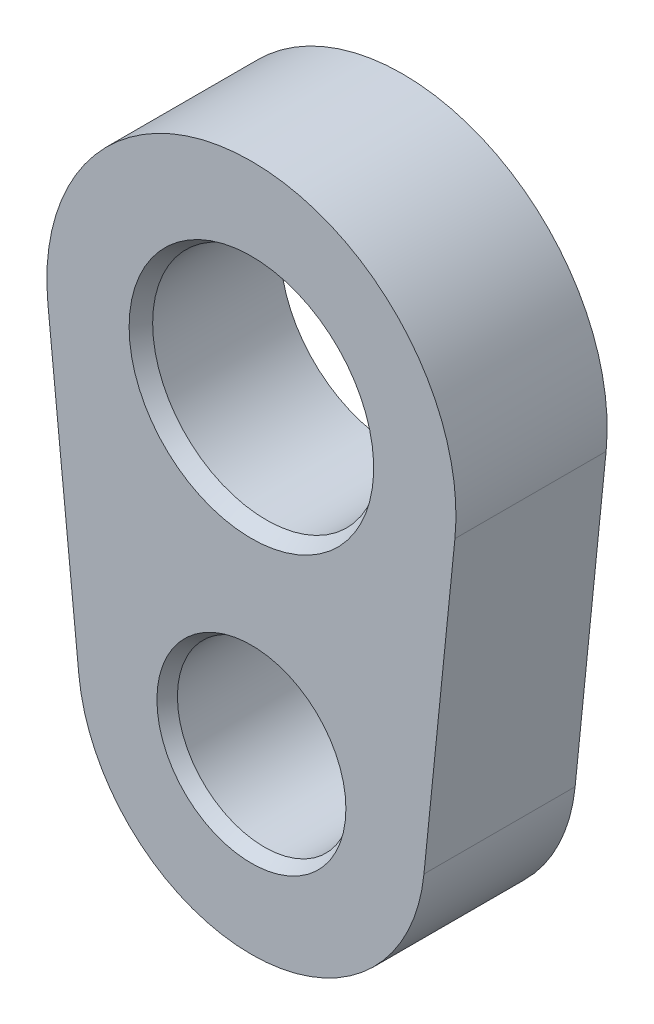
from build123d import *
from OCP.BRepFilletAPI import BRepFilletAPI_MakeChamfer

# Parameters (mm, degrees)
SKETCH1_R           = 1.98755
SKETCH1_R_2         = 2.59715
BOSS_EXTRUDE1_DEPTH = 3.4544
CHAMFER1_SIZE       = 0.19685
CHAMFER1_SIZE2      = 0.340954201
CHAMFER2_SIZE       = 0.17145
CHAMFER2_SIZE2      = 0.296960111


with BuildPart() as part:
    # Sketch1 → Boss-Extrude1 (new body)
    with BuildSketch(Plane.XY):
        with BuildLine():
            Line((-3.942250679, -0.399090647), (-4.649834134, 6.590477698))
            ThreePointArc((-4.649834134, 6.590477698), (0, 11.7348), (4.649834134, 6.590477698))
            Line((4.649834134, 6.590477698), (3.942250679, -0.399090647))
            ThreePointArc((3.942250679, -0.399090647), (0, -3.9624), (-3.942250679, -0.399090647))
        make_face()
        Circle(SKETCH1_R, mode=Mode.SUBTRACT)
        with Locations((0, 7.0612)):
            Circle(SKETCH1_R_2, mode=Mode.SUBTRACT)
    extrude(amount=BOSS_EXTRUDE1_DEPTH)

    # Chamfer1: one chamfer whose edges measure the first distance from different faces: ONE call of the kernel's chamfer builder (chamfer() names one face for all edges)
    chamfer1_edges_1 = [part.edges().sort_by_distance(p)[0] for p in [
        (-2.59715, 7.0612, 0),
    ]]
    chamfer1_side_1 = [part.faces().sort_by_distance(p)[0] for p in [
        (-2.59715, 7.0612, 1.7272),
    ]]
    chamfer1_edges_2 = [part.edges().sort_by_distance(p)[0] for p in [
        (-2.59715, 7.0612, 3.4544),
    ]]
    chamfer1_side_2 = [part.faces().sort_by_distance(p)[0] for p in [
        (0, 3.940684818, 3.4544),
    ]]
    chamfer1 = BRepFilletAPI_MakeChamfer(part.part.solid().wrapped)
    for e in chamfer1_edges_1:
        chamfer1.Add(CHAMFER1_SIZE, CHAMFER1_SIZE2, e.wrapped, chamfer1_side_1[0].wrapped)  # the first distance lies on this face
    for e in chamfer1_edges_2:
        chamfer1.Add(CHAMFER1_SIZE, CHAMFER1_SIZE2, e.wrapped, chamfer1_side_2[0].wrapped)  # the first distance lies on this face
    add(Compound.cast(chamfer1.Shape()), mode=Mode.REPLACE)

    # Chamfer2: one chamfer whose edges measure the first distance from different faces: ONE call of the kernel's chamfer builder (chamfer() names one face for all edges)
    chamfer2_edges_1 = [part.edges().sort_by_distance(p)[0] for p in [
        (-1.98755, 0, 0),
    ]]
    chamfer2_side_1 = [part.faces().sort_by_distance(p)[0] for p in [
        (-1.98755, 0, 1.7272),
    ]]
    chamfer2_edges_2 = [part.edges().sort_by_distance(p)[0] for p in [
        (-1.98755, 0, 3.4544),
    ]]
    chamfer2_side_2 = [part.faces().sort_by_distance(p)[0] for p in [
        (0, 3.815830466, 3.4544),
    ]]
    chamfer2 = BRepFilletAPI_MakeChamfer(part.part.solid().wrapped)
    for e in chamfer2_edges_1:
        chamfer2.Add(CHAMFER2_SIZE, CHAMFER2_SIZE2, e.wrapped, chamfer2_side_1[0].wrapped)  # the first distance lies on this face
    for e in chamfer2_edges_2:
        chamfer2.Add(CHAMFER2_SIZE, CHAMFER2_SIZE2, e.wrapped, chamfer2_side_2[0].wrapped)  # the first distance lies on this face
    add(Compound.cast(chamfer2.Shape()), mode=Mode.REPLACE)


solid = part.part
